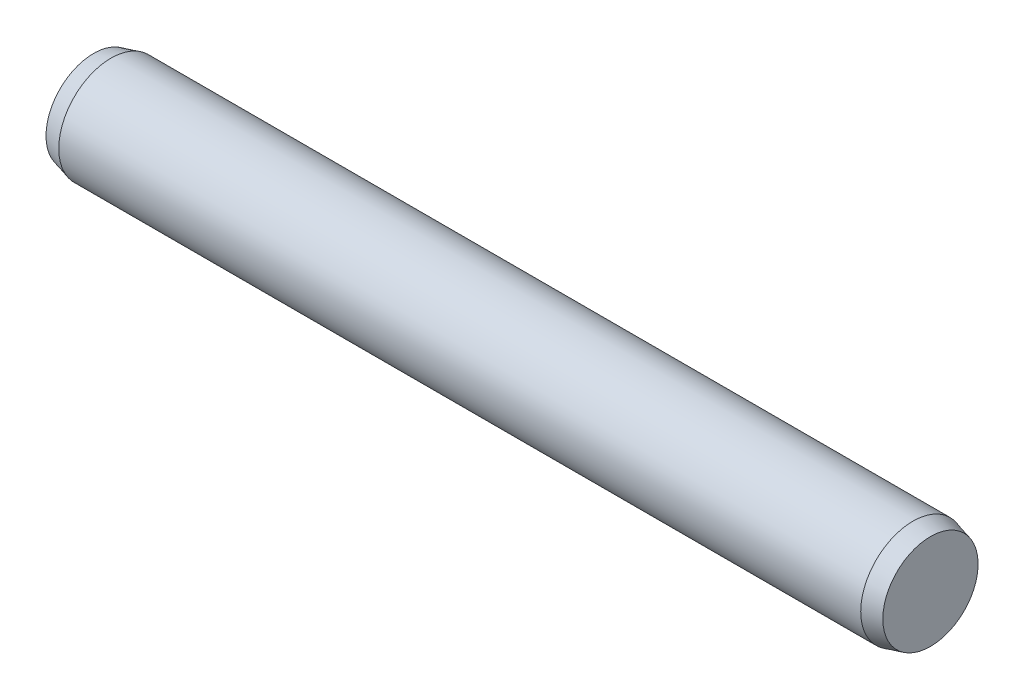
ISO-10303-21;
HEADER;
FILE_DESCRIPTION(('STEP AP214'),'2;1');
FILE_NAME('part.step','',(''),(''),'','','');
FILE_SCHEMA(('AUTOMOTIVE_DESIGN { 1 0 10303 214 1 1 1 1 }'));
ENDSEC;
DATA;
#1=APPLICATION_CONTEXT('core data for automotive mechanical design processes');
#2=APPLICATION_PROTOCOL_DEFINITION('international standard','automotive_design',2000,#1);
#3=PRODUCT_CONTEXT('',#1,'mechanical');
#4=PRODUCT('Part','Part','',(#3));
#5=PRODUCT_RELATED_PRODUCT_CATEGORY('part','',(#4));
#6=PRODUCT_DEFINITION_FORMATION('','',#4);
#7=PRODUCT_DEFINITION_CONTEXT('part definition',#1,'design');
#8=PRODUCT_DEFINITION('design','',#6,#7);
#9=PRODUCT_DEFINITION_SHAPE('','',#8);
#10=(LENGTH_UNIT() NAMED_UNIT(*) SI_UNIT(.MILLI.,.METRE.));
#11=(NAMED_UNIT(*) PLANE_ANGLE_UNIT() SI_UNIT($,.RADIAN.));
#12=(NAMED_UNIT(*) SI_UNIT($,.STERADIAN.) SOLID_ANGLE_UNIT());
#13=UNCERTAINTY_MEASURE_WITH_UNIT(LENGTH_MEASURE(1.E-05),#10,'distance_accuracy_value','');
#14=(GEOMETRIC_REPRESENTATION_CONTEXT(3) GLOBAL_UNCERTAINTY_ASSIGNED_CONTEXT((#13)) GLOBAL_UNIT_ASSIGNED_CONTEXT((#10,
#11,#12)) REPRESENTATION_CONTEXT('',''));
#15=CARTESIAN_POINT('',(0.,0.,0.));
#16=DIRECTION('',(0.,0.,1.));
#17=DIRECTION('',(1.,0.,0.));
#18=AXIS2_PLACEMENT_3D('',#15,#16,#17);
#19=CARTESIAN_POINT('',(0.,1.36602540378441,0.));
#20=DIRECTION('',(1.,0.,0.));
#21=DIRECTION('',(0.,0.,-1.));
#22=AXIS2_PLACEMENT_3D('',#19,#20,#21);
#23=PLANE('',#22);
#24=CARTESIAN_POINT('',(0.,0.,0.));
#25=DIRECTION('',(-1.,0.,0.));
#26=DIRECTION('',(0.,0.,1.));
#27=AXIS2_PLACEMENT_3D('',#24,#25,#26);
#28=CIRCLE('',#27,1.36602540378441);
#29=CARTESIAN_POINT('',(0.,0.,1.36602540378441));
#30=VERTEX_POINT('',#29);
#31=EDGE_CURVE('E38',#30,#30,#28,.T.);
#32=ORIENTED_EDGE('',*,*,#31,.T.);
#33=EDGE_LOOP('',(#32));
#34=FACE_BOUND('',#33,.T.);
#35=ADVANCED_FACE('F24',(#34),#23,.F.);
#36=CARTESIAN_POINT('',(24.,0.,0.));
#37=DIRECTION('',(-1.,0.,0.));
#38=DIRECTION('',(0.,0.,1.));
#39=AXIS2_PLACEMENT_3D('',#36,#37,#38);
#40=PLANE('',#39);
#41=CARTESIAN_POINT('',(24.,0.,0.));
#42=DIRECTION('',(-1.,0.,0.));
#43=DIRECTION('',(0.,0.,1.));
#44=AXIS2_PLACEMENT_3D('',#41,#42,#43);
#45=CIRCLE('',#44,1.36602540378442);
#46=CARTESIAN_POINT('',(24.,0.,1.36602540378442));
#47=VERTEX_POINT('',#46);
#48=EDGE_CURVE('E10',#47,#47,#45,.T.);
#49=ORIENTED_EDGE('',*,*,#48,.F.);
#50=EDGE_LOOP('',(#49));
#51=FACE_BOUND('',#50,.T.);
#52=ADVANCED_FACE('F58',(#51),#40,.F.);
#53=CARTESIAN_POINT('',(24.,0.,0.));
#54=DIRECTION('',(-1.,0.,0.));
#55=DIRECTION('',(0.,0.,1.));
#56=AXIS2_PLACEMENT_3D('',#53,#54,#55);
#57=CONICAL_SURFACE('',#56,1.36602540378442,0.26179938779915);
#58=CARTESIAN_POINT('',(23.5,0.,0.));
#59=DIRECTION('',(-1.,0.,0.));
#60=DIRECTION('',(0.,0.,1.));
#61=AXIS2_PLACEMENT_3D('',#58,#59,#60);
#62=CIRCLE('',#61,1.49999999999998);
#63=CARTESIAN_POINT('',(23.5,0.,1.49999999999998));
#64=VERTEX_POINT('',#63);
#65=EDGE_CURVE('E30',#64,#64,#62,.T.);
#66=ORIENTED_EDGE('',*,*,#65,.F.);
#67=EDGE_LOOP('',(#66));
#68=FACE_BOUND('',#67,.T.);
#69=ORIENTED_EDGE('',*,*,#48,.T.);
#70=EDGE_LOOP('',(#69));
#71=FACE_BOUND('',#70,.T.);
#72=ADVANCED_FACE('F53',(#68,#71),#57,.T.);
#73=CARTESIAN_POINT('',(-6.35,0.,0.));
#74=DIRECTION('',(-1.,0.,0.));
#75=DIRECTION('',(0.,0.,1.));
#76=AXIS2_PLACEMENT_3D('',#73,#74,#75);
#77=CYLINDRICAL_SURFACE('',#76,1.49999999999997);
#78=CARTESIAN_POINT('',(0.5,0.,0.));
#79=DIRECTION('',(-1.,0.,0.));
#80=DIRECTION('',(0.,0.,1.));
#81=AXIS2_PLACEMENT_3D('',#78,#79,#80);
#82=CIRCLE('',#81,1.49999999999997);
#83=CARTESIAN_POINT('',(0.5,0.,1.49999999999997));
#84=VERTEX_POINT('',#83);
#85=EDGE_CURVE('E34',#84,#84,#82,.T.);
#86=ORIENTED_EDGE('',*,*,#85,.F.);
#87=EDGE_LOOP('',(#86));
#88=FACE_BOUND('',#87,.T.);
#89=ORIENTED_EDGE('',*,*,#65,.T.);
#90=EDGE_LOOP('',(#89));
#91=FACE_BOUND('',#90,.T.);
#92=ADVANCED_FACE('F48',(#88,#91),#77,.T.);
#93=CARTESIAN_POINT('',(0.5,0.,0.));
#94=DIRECTION('',(1.,0.,0.));
#95=DIRECTION('',(0.,0.,-1.));
#96=AXIS2_PLACEMENT_3D('',#93,#94,#95);
#97=CONICAL_SURFACE('',#96,1.49999999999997,0.26179938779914);
#98=ORIENTED_EDGE('',*,*,#31,.F.);
#99=EDGE_LOOP('',(#98));
#100=FACE_BOUND('',#99,.T.);
#101=ORIENTED_EDGE('',*,*,#85,.T.);
#102=EDGE_LOOP('',(#101));
#103=FACE_BOUND('',#102,.T.);
#104=ADVANCED_FACE('F45',(#100,#103),#97,.T.);
#105=CLOSED_SHELL('',(#35,#52,#72,#92,#104));
#106=MANIFOLD_SOLID_BREP('B2',#105);
#107=ADVANCED_BREP_SHAPE_REPRESENTATION('',(#18,#106),#14);
#108=SHAPE_DEFINITION_REPRESENTATION(#9,#107);
ENDSEC;
END-ISO-10303-21;
